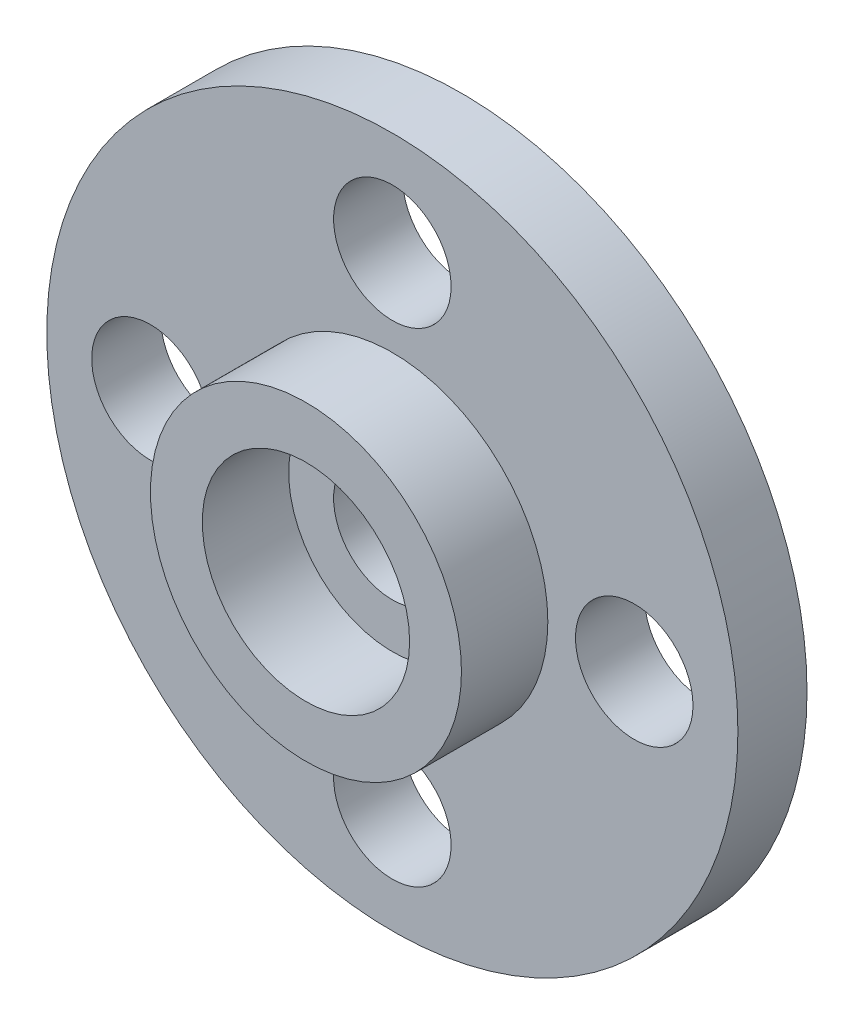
ISO-10303-21;
HEADER;
FILE_DESCRIPTION(('STEP AP214'),'2;1');
FILE_NAME('part.step','',(''),(''),'','','');
FILE_SCHEMA(('AUTOMOTIVE_DESIGN { 1 0 10303 214 1 1 1 1 }'));
ENDSEC;
DATA;
#1=APPLICATION_CONTEXT('core data for automotive mechanical design processes');
#2=APPLICATION_PROTOCOL_DEFINITION('international standard','automotive_design',2000,#1);
#3=PRODUCT_CONTEXT('',#1,'mechanical');
#4=PRODUCT('Part','Part','',(#3));
#5=PRODUCT_RELATED_PRODUCT_CATEGORY('part','',(#4));
#6=PRODUCT_DEFINITION_FORMATION('','',#4);
#7=PRODUCT_DEFINITION_CONTEXT('part definition',#1,'design');
#8=PRODUCT_DEFINITION('design','',#6,#7);
#9=PRODUCT_DEFINITION_SHAPE('','',#8);
#10=(LENGTH_UNIT() NAMED_UNIT(*) SI_UNIT(.MILLI.,.METRE.));
#11=(NAMED_UNIT(*) PLANE_ANGLE_UNIT() SI_UNIT($,.RADIAN.));
#12=(NAMED_UNIT(*) SI_UNIT($,.STERADIAN.) SOLID_ANGLE_UNIT());
#13=UNCERTAINTY_MEASURE_WITH_UNIT(LENGTH_MEASURE(1.E-05),#10,'distance_accuracy_value','');
#14=(GEOMETRIC_REPRESENTATION_CONTEXT(3) GLOBAL_UNCERTAINTY_ASSIGNED_CONTEXT((#13)) GLOBAL_UNIT_ASSIGNED_CONTEXT((#10,
#11,#12)) REPRESENTATION_CONTEXT('',''));
#15=CARTESIAN_POINT('',(0.,0.,0.));
#16=DIRECTION('',(0.,0.,1.));
#17=DIRECTION('',(1.,0.,0.));
#18=AXIS2_PLACEMENT_3D('',#15,#16,#17);
#19=CARTESIAN_POINT('',(0.,0.,2.));
#20=DIRECTION('',(0.,0.,1.));
#21=DIRECTION('',(1.,0.,0.));
#22=AXIS2_PLACEMENT_3D('',#19,#20,#21);
#23=PLANE('',#22);
#24=CARTESIAN_POINT('',(0.,0.,2.));
#25=DIRECTION('',(0.,0.,1.));
#26=DIRECTION('',(1.,0.,0.));
#27=AXIS2_PLACEMENT_3D('',#24,#25,#26);
#28=CIRCLE('',#27,1.7);
#29=CARTESIAN_POINT('',(1.7,0.,2.));
#30=VERTEX_POINT('',#29);
#31=EDGE_CURVE('E59',#30,#30,#28,.T.);
#32=ORIENTED_EDGE('',*,*,#31,.F.);
#33=EDGE_LOOP('',(#32));
#34=FACE_BOUND('',#33,.T.);
#35=CARTESIAN_POINT('',(0.,0.,2.));
#36=DIRECTION('',(0.,0.,1.));
#37=DIRECTION('',(1.,0.,0.));
#38=AXIS2_PLACEMENT_3D('',#35,#36,#37);
#39=CIRCLE('',#38,3.);
#40=CARTESIAN_POINT('',(3.,0.,2.));
#41=VERTEX_POINT('',#40);
#42=EDGE_CURVE('E11',#41,#41,#39,.F.);
#43=ORIENTED_EDGE('',*,*,#42,.F.);
#44=EDGE_LOOP('',(#43));
#45=FACE_BOUND('',#44,.T.);
#46=ADVANCED_FACE('F39',(#34,#45),#23,.T.);
#47=CARTESIAN_POINT('',(0.,0.,2.));
#48=DIRECTION('',(0.,0.,-1.));
#49=DIRECTION('',(-1.,0.,0.));
#50=AXIS2_PLACEMENT_3D('',#47,#48,#49);
#51=CYLINDRICAL_SURFACE('',#50,10.);
#52=CARTESIAN_POINT('',(0.,0.,2.));
#53=DIRECTION('',(0.,0.,1.));
#54=DIRECTION('',(1.,0.,0.));
#55=AXIS2_PLACEMENT_3D('',#52,#53,#54);
#56=CIRCLE('',#55,10.);
#57=CARTESIAN_POINT('',(10.,0.,2.));
#58=VERTEX_POINT('',#57);
#59=EDGE_CURVE('E46',#58,#58,#56,.T.);
#60=ORIENTED_EDGE('',*,*,#59,.F.);
#61=EDGE_LOOP('',(#60));
#62=FACE_BOUND('',#61,.T.);
#63=CARTESIAN_POINT('',(0.,0.,0.));
#64=DIRECTION('',(0.,0.,1.));
#65=DIRECTION('',(1.,0.,0.));
#66=AXIS2_PLACEMENT_3D('',#63,#64,#65);
#67=CIRCLE('',#66,10.);
#68=CARTESIAN_POINT('',(10.,0.,0.));
#69=VERTEX_POINT('',#68);
#70=EDGE_CURVE('E50',#69,#69,#67,.T.);
#71=ORIENTED_EDGE('',*,*,#70,.T.);
#72=EDGE_LOOP('',(#71));
#73=FACE_BOUND('',#72,.T.);
#74=ADVANCED_FACE('F41',(#62,#73),#51,.T.);
#75=CARTESIAN_POINT('',(0.,0.,2.));
#76=DIRECTION('',(0.,0.,1.));
#77=DIRECTION('',(1.,0.,0.));
#78=AXIS2_PLACEMENT_3D('',#75,#76,#77);
#79=CIRCLE('',#78,4.5);
#80=CARTESIAN_POINT('',(4.5,0.,2.));
#81=VERTEX_POINT('',#80);
#82=EDGE_CURVE('E87',#81,#81,#79,.T.);
#83=ORIENTED_EDGE('',*,*,#82,.F.);
#84=EDGE_LOOP('',(#83));
#85=FACE_BOUND('',#84,.T.);
#86=CARTESIAN_POINT('',(-7.,0.,2.));
#87=DIRECTION('',(0.,0.,1.));
#88=DIRECTION('',(1.,0.,0.));
#89=AXIS2_PLACEMENT_3D('',#86,#87,#88);
#90=CIRCLE('',#89,1.7);
#91=CARTESIAN_POINT('',(-5.3,0.,2.));
#92=VERTEX_POINT('',#91);
#93=EDGE_CURVE('E83',#92,#92,#90,.T.);
#94=ORIENTED_EDGE('',*,*,#93,.F.);
#95=EDGE_LOOP('',(#94));
#96=FACE_BOUND('',#95,.T.);
#97=CARTESIAN_POINT('',(7.,0.,2.));
#98=DIRECTION('',(0.,0.,1.));
#99=DIRECTION('',(1.,0.,0.));
#100=AXIS2_PLACEMENT_3D('',#97,#98,#99);
#101=CIRCLE('',#100,1.7);
#102=CARTESIAN_POINT('',(8.7,0.,2.));
#103=VERTEX_POINT('',#102);
#104=EDGE_CURVE('E77',#103,#103,#101,.T.);
#105=ORIENTED_EDGE('',*,*,#104,.F.);
#106=EDGE_LOOP('',(#105));
#107=FACE_BOUND('',#106,.T.);
#108=CARTESIAN_POINT('',(0.,7.,2.));
#109=DIRECTION('',(0.,0.,1.));
#110=DIRECTION('',(1.,0.,0.));
#111=AXIS2_PLACEMENT_3D('',#108,#109,#110);
#112=CIRCLE('',#111,1.7);
#113=CARTESIAN_POINT('',(1.7,7.,2.));
#114=VERTEX_POINT('',#113);
#115=EDGE_CURVE('E71',#114,#114,#112,.T.);
#116=ORIENTED_EDGE('',*,*,#115,.F.);
#117=EDGE_LOOP('',(#116));
#118=FACE_BOUND('',#117,.T.);
#119=CARTESIAN_POINT('',(0.,-7.,2.));
#120=DIRECTION('',(0.,0.,1.));
#121=DIRECTION('',(1.,0.,0.));
#122=AXIS2_PLACEMENT_3D('',#119,#120,#121);
#123=CIRCLE('',#122,1.7);
#124=CARTESIAN_POINT('',(1.7,-7.,2.));
#125=VERTEX_POINT('',#124);
#126=EDGE_CURVE('E65',#125,#125,#123,.T.);
#127=ORIENTED_EDGE('',*,*,#126,.F.);
#128=EDGE_LOOP('',(#127));
#129=FACE_BOUND('',#128,.T.);
#130=ORIENTED_EDGE('',*,*,#59,.T.);
#131=EDGE_LOOP('',(#130));
#132=FACE_BOUND('',#131,.T.);
#133=ADVANCED_FACE('F117',(#85,#96,#107,#118,#129,#132),#23,.T.);
#134=CARTESIAN_POINT('',(0.,0.,0.));
#135=DIRECTION('',(0.,0.,1.));
#136=DIRECTION('',(1.,0.,0.));
#137=AXIS2_PLACEMENT_3D('',#134,#135,#136);
#138=PLANE('',#137);
#139=CARTESIAN_POINT('',(-7.,0.,0.));
#140=DIRECTION('',(0.,0.,1.));
#141=DIRECTION('',(1.,0.,0.));
#142=AXIS2_PLACEMENT_3D('',#139,#140,#141);
#143=CIRCLE('',#142,1.7);
#144=CARTESIAN_POINT('',(-5.3,0.,0.));
#145=VERTEX_POINT('',#144);
#146=EDGE_CURVE('E80',#145,#145,#143,.T.);
#147=ORIENTED_EDGE('',*,*,#146,.T.);
#148=EDGE_LOOP('',(#147));
#149=FACE_BOUND('',#148,.T.);
#150=CARTESIAN_POINT('',(7.,0.,0.));
#151=DIRECTION('',(0.,0.,1.));
#152=DIRECTION('',(1.,0.,0.));
#153=AXIS2_PLACEMENT_3D('',#150,#151,#152);
#154=CIRCLE('',#153,1.7);
#155=CARTESIAN_POINT('',(8.7,0.,0.));
#156=VERTEX_POINT('',#155);
#157=EDGE_CURVE('E74',#156,#156,#154,.T.);
#158=ORIENTED_EDGE('',*,*,#157,.T.);
#159=EDGE_LOOP('',(#158));
#160=FACE_BOUND('',#159,.T.);
#161=CARTESIAN_POINT('',(0.,7.,0.));
#162=DIRECTION('',(0.,0.,1.));
#163=DIRECTION('',(1.,0.,0.));
#164=AXIS2_PLACEMENT_3D('',#161,#162,#163);
#165=CIRCLE('',#164,1.7);
#166=CARTESIAN_POINT('',(1.7,7.,0.));
#167=VERTEX_POINT('',#166);
#168=EDGE_CURVE('E68',#167,#167,#165,.T.);
#169=ORIENTED_EDGE('',*,*,#168,.T.);
#170=EDGE_LOOP('',(#169));
#171=FACE_BOUND('',#170,.T.);
#172=CARTESIAN_POINT('',(0.,-7.,0.));
#173=DIRECTION('',(0.,0.,1.));
#174=DIRECTION('',(1.,0.,0.));
#175=AXIS2_PLACEMENT_3D('',#172,#173,#174);
#176=CIRCLE('',#175,1.7);
#177=CARTESIAN_POINT('',(1.7,-7.,0.));
#178=VERTEX_POINT('',#177);
#179=EDGE_CURVE('E62',#178,#178,#176,.T.);
#180=ORIENTED_EDGE('',*,*,#179,.T.);
#181=EDGE_LOOP('',(#180));
#182=FACE_BOUND('',#181,.T.);
#183=CARTESIAN_POINT('',(0.,0.,0.));
#184=DIRECTION('',(0.,0.,1.));
#185=DIRECTION('',(1.,0.,0.));
#186=AXIS2_PLACEMENT_3D('',#183,#184,#185);
#187=CIRCLE('',#186,1.7);
#188=CARTESIAN_POINT('',(1.7,0.,0.));
#189=VERTEX_POINT('',#188);
#190=EDGE_CURVE('E55',#189,#189,#187,.T.);
#191=ORIENTED_EDGE('',*,*,#190,.T.);
#192=EDGE_LOOP('',(#191));
#193=FACE_BOUND('',#192,.T.);
#194=ORIENTED_EDGE('',*,*,#70,.F.);
#195=EDGE_LOOP('',(#194));
#196=FACE_BOUND('',#195,.T.);
#197=ADVANCED_FACE('F126',(#149,#160,#171,#182,#193,#196),#138,.F.);
#198=CARTESIAN_POINT('',(0.,0.,2.));
#199=DIRECTION('',(0.,0.,1.));
#200=DIRECTION('',(1.,0.,0.));
#201=AXIS2_PLACEMENT_3D('',#198,#199,#200);
#202=CYLINDRICAL_SURFACE('',#201,1.7);
#203=ORIENTED_EDGE('',*,*,#190,.F.);
#204=EDGE_LOOP('',(#203));
#205=FACE_BOUND('',#204,.T.);
#206=ORIENTED_EDGE('',*,*,#31,.T.);
#207=EDGE_LOOP('',(#206));
#208=FACE_BOUND('',#207,.T.);
#209=ADVANCED_FACE('F131',(#205,#208),#202,.F.);
#210=CARTESIAN_POINT('',(0.,-7.,2.));
#211=DIRECTION('',(0.,0.,1.));
#212=DIRECTION('',(1.,0.,0.));
#213=AXIS2_PLACEMENT_3D('',#210,#211,#212);
#214=CYLINDRICAL_SURFACE('',#213,1.7);
#215=ORIENTED_EDGE('',*,*,#179,.F.);
#216=EDGE_LOOP('',(#215));
#217=FACE_BOUND('',#216,.T.);
#218=ORIENTED_EDGE('',*,*,#126,.T.);
#219=EDGE_LOOP('',(#218));
#220=FACE_BOUND('',#219,.T.);
#221=ADVANCED_FACE('F143',(#217,#220),#214,.F.);
#222=CARTESIAN_POINT('',(0.,7.,2.));
#223=DIRECTION('',(0.,0.,1.));
#224=DIRECTION('',(1.,0.,0.));
#225=AXIS2_PLACEMENT_3D('',#222,#223,#224);
#226=CYLINDRICAL_SURFACE('',#225,1.7);
#227=ORIENTED_EDGE('',*,*,#168,.F.);
#228=EDGE_LOOP('',(#227));
#229=FACE_BOUND('',#228,.T.);
#230=ORIENTED_EDGE('',*,*,#115,.T.);
#231=EDGE_LOOP('',(#230));
#232=FACE_BOUND('',#231,.T.);
#233=ADVANCED_FACE('F145',(#229,#232),#226,.F.);
#234=CARTESIAN_POINT('',(7.,0.,2.));
#235=DIRECTION('',(0.,0.,1.));
#236=DIRECTION('',(1.,0.,0.));
#237=AXIS2_PLACEMENT_3D('',#234,#235,#236);
#238=CYLINDRICAL_SURFACE('',#237,1.7);
#239=ORIENTED_EDGE('',*,*,#157,.F.);
#240=EDGE_LOOP('',(#239));
#241=FACE_BOUND('',#240,.T.);
#242=ORIENTED_EDGE('',*,*,#104,.T.);
#243=EDGE_LOOP('',(#242));
#244=FACE_BOUND('',#243,.T.);
#245=ADVANCED_FACE('F110',(#241,#244),#238,.F.);
#246=CARTESIAN_POINT('',(-7.,0.,2.));
#247=DIRECTION('',(0.,0.,1.));
#248=DIRECTION('',(1.,0.,0.));
#249=AXIS2_PLACEMENT_3D('',#246,#247,#248);
#250=CYLINDRICAL_SURFACE('',#249,1.7);
#251=ORIENTED_EDGE('',*,*,#146,.F.);
#252=EDGE_LOOP('',(#251));
#253=FACE_BOUND('',#252,.T.);
#254=ORIENTED_EDGE('',*,*,#93,.T.);
#255=EDGE_LOOP('',(#254));
#256=FACE_BOUND('',#255,.T.);
#257=ADVANCED_FACE('F101',(#253,#256),#250,.F.);
#258=CARTESIAN_POINT('',(0.,0.,4.5));
#259=DIRECTION('',(0.,0.,1.));
#260=DIRECTION('',(1.,0.,0.));
#261=AXIS2_PLACEMENT_3D('',#258,#259,#260);
#262=PLANE('',#261);
#263=CARTESIAN_POINT('',(0.,0.,4.5));
#264=DIRECTION('',(0.,0.,1.));
#265=DIRECTION('',(1.,0.,0.));
#266=AXIS2_PLACEMENT_3D('',#263,#264,#265);
#267=CIRCLE('',#266,4.5);
#268=CARTESIAN_POINT('',(4.5,0.,4.5));
#269=VERTEX_POINT('',#268);
#270=EDGE_CURVE('E86',#269,#269,#267,.T.);
#271=ORIENTED_EDGE('',*,*,#270,.T.);
#272=EDGE_LOOP('',(#271));
#273=FACE_BOUND('',#272,.T.);
#274=CARTESIAN_POINT('',(0.,0.,4.5));
#275=DIRECTION('',(0.,0.,1.));
#276=DIRECTION('',(1.,0.,0.));
#277=AXIS2_PLACEMENT_3D('',#274,#275,#276);
#278=CIRCLE('',#277,3.);
#279=CARTESIAN_POINT('',(3.,0.,4.5));
#280=VERTEX_POINT('',#279);
#281=EDGE_CURVE('E90',#280,#280,#278,.T.);
#282=ORIENTED_EDGE('',*,*,#281,.F.);
#283=EDGE_LOOP('',(#282));
#284=FACE_BOUND('',#283,.T.);
#285=ADVANCED_FACE('F98',(#273,#284),#262,.T.);
#286=CARTESIAN_POINT('',(0.,0.,4.5));
#287=DIRECTION('',(0.,0.,-1.));
#288=DIRECTION('',(-1.,0.,0.));
#289=AXIS2_PLACEMENT_3D('',#286,#287,#288);
#290=CYLINDRICAL_SURFACE('',#289,4.5);
#291=ORIENTED_EDGE('',*,*,#270,.F.);
#292=EDGE_LOOP('',(#291));
#293=FACE_BOUND('',#292,.T.);
#294=ORIENTED_EDGE('',*,*,#82,.T.);
#295=EDGE_LOOP('',(#294));
#296=FACE_BOUND('',#295,.T.);
#297=ADVANCED_FACE('F100',(#293,#296),#290,.T.);
#298=CARTESIAN_POINT('',(0.,0.,4.5));
#299=DIRECTION('',(0.,0.,-1.));
#300=DIRECTION('',(-1.,0.,0.));
#301=AXIS2_PLACEMENT_3D('',#298,#299,#300);
#302=CYLINDRICAL_SURFACE('',#301,3.);
#303=ORIENTED_EDGE('',*,*,#281,.T.);
#304=EDGE_LOOP('',(#303));
#305=FACE_BOUND('',#304,.T.);
#306=ORIENTED_EDGE('',*,*,#42,.T.);
#307=EDGE_LOOP('',(#306));
#308=FACE_BOUND('',#307,.T.);
#309=ADVANCED_FACE('F96',(#305,#308),#302,.F.);
#310=CLOSED_SHELL('',(#46,#74,#133,#197,#209,#221,#233,#245,#257,#285,#297,#309));
#311=MANIFOLD_SOLID_BREP('B2',#310);
#312=ADVANCED_BREP_SHAPE_REPRESENTATION('',(#18,#311),#14);
#313=SHAPE_DEFINITION_REPRESENTATION(#9,#312);
ENDSEC;
END-ISO-10303-21;
